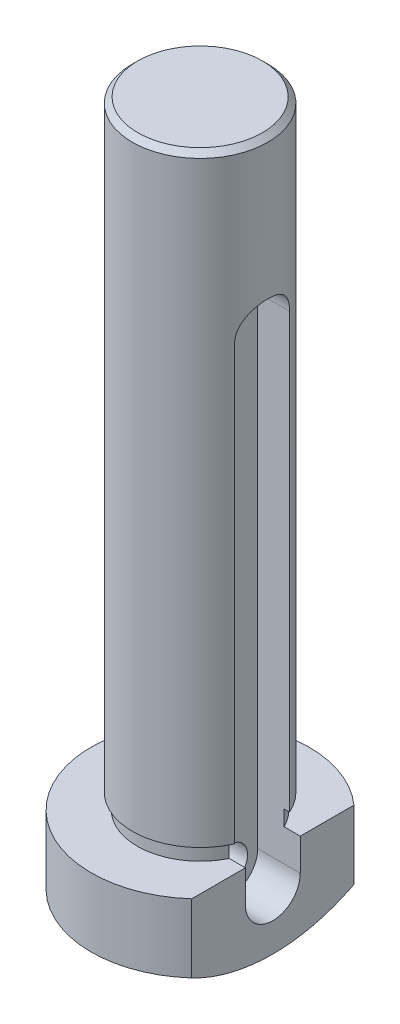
from build123d import *

# Parameters (mm, degrees)
CUT_EXTRUDE1_DEPTH = 5.08
SKETCH4_W          = 3.16899376
SKETCH4_H          = 12.101330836
CUT_EXTRUDE2_DEPTH = 38.1
SKETCH5_R          = 0.8001
CUT_EXTRUDE3_DEPTH = 1.3716
SKETCH6_R          = 0.8001
CUT_EXTRUDE4_DEPTH = 8.9916
CHAMFER1_SIZE      = 0.254


with BuildPart() as part:
    # Sketch1 → Revolve1 (revolve)
    with BuildSketch(Plane.XY, mode=Mode.PRIVATE) as revolve1_sk:
        with BuildLine():
            Line((5.0419, 1.5875), (5.0419, 4.7625))
            Line((5.0419, 4.7625), (2.9083, 4.7625))
            Line((2.9083, 4.7625), (2.9083, 5.4737))
            Line((2.9083, 5.4737), (3.1369, 5.4737))
            Line((3.1369, 5.4737), (3.1369, 33.3502))
            Line((3.1369, 33.3502), (0, 33.3502))
            Line((0, 33.3502), (0, 0))
            ThreePointArc((0, 0), (2.642958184, 0.406252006), (5.0419, 1.5875))
        make_face()
    revolve(revolve1_sk.sketch.rotate(Axis((0, 0, 0), (0, -1, 0)), 90), axis=Axis((0, 0, 0), (0, -1, 0)))

    # Sketch3 → Cut-Extrude1 (cut)
    with BuildSketch(Plane(origin=(1.397, 0, 0), x_dir=(0, 0, -1), z_dir=(1, 0, 0))):
        with BuildLine():
            Line((1.27, 25.5524), (1.27, 3.2766))
            ThreePointArc((1.27, 3.2766), (0, 2.0066), (-1.27, 3.2766))
            Line((-1.27, 3.2766), (-1.27, 25.5524))
            ThreePointArc((-1.27, 25.5524), (0, 26.8224), (1.27, 25.5524))
        make_face()
    extrude(amount=CUT_EXTRUDE1_DEPTH, mode=Mode.SUBTRACT)

    # Sketch4 → Cut-Extrude2 (cut)
    with BuildSketch(Plane(origin=(0, 33.3502, 0), x_dir=(1, 0, 0), z_dir=(0, 1, 0))):
        with Locations((4.94999688, -0.360561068)):
            Rectangle(SKETCH4_W, SKETCH4_H)
    extrude(amount=-CUT_EXTRUDE2_DEPTH, mode=Mode.SUBTRACT)

    # Sketch5 → Cut-Extrude3 (cut)
    with BuildSketch(Plane(origin=(1.397, 0, 0), x_dir=(0, 0, -1), z_dir=(1, 0, 0))):
        with Locations((0, 25.5524)):
            Circle(SKETCH5_R)
        with Locations((0, 3.2766)):
            Circle(SKETCH5_R)
    extrude(amount=-CUT_EXTRUDE3_DEPTH, mode=Mode.SUBTRACT)

    # Sketch6 → Cut-Extrude4 (cut)
    with BuildSketch(Plane(origin=(0.0254, 0, 0), x_dir=(0, 0, -1), z_dir=(1, 0, 0))):
        with Locations((0, 25.5524)):
            Circle(SKETCH6_R)
    extrude(amount=-CUT_EXTRUDE4_DEPTH, mode=Mode.SUBTRACT)

    # Chamfer1
    chamfer1_edges = [part.edges().sort_by_distance(p)[0] for p in [
        (0, 33.3502, -3.1369),
    ]]
    chamfer(chamfer1_edges, length=CHAMFER1_SIZE)


solid = part.part
